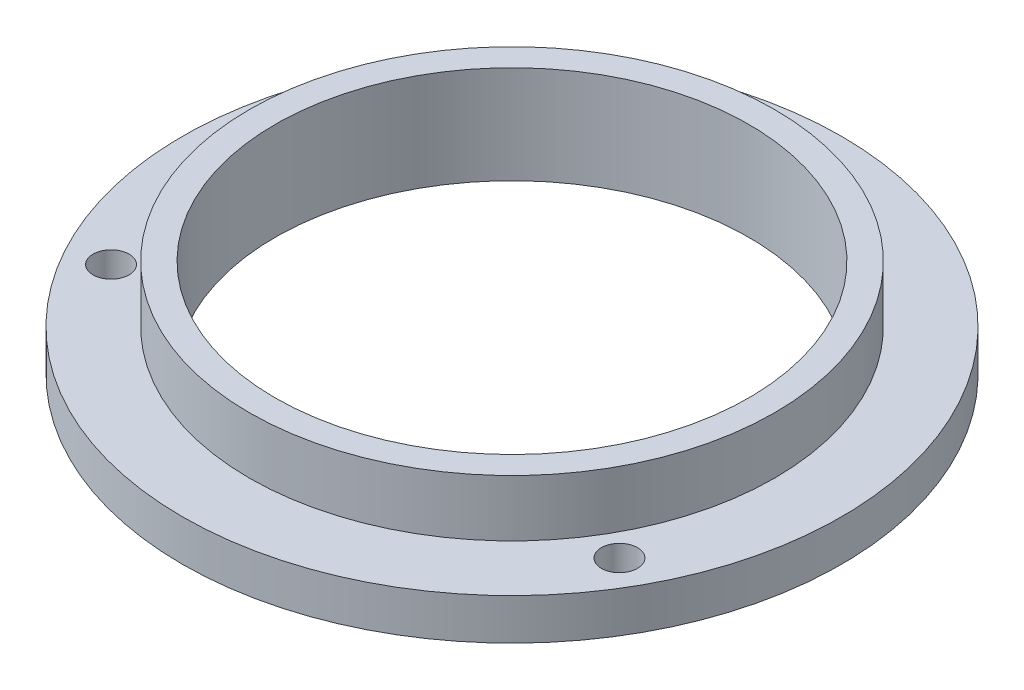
from build123d import *

# Parameters (mm, degrees)
SCHIZZO2_R               = 1.75
TAGLIO_ESTRUSIONE1_DEPTH = 46.587827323


with BuildPart() as part:
    # Schizzo1 → Rivoluzione1 (revolve)
    with BuildSketch(Plane.XY, mode=Mode.PRIVATE) as rivoluzione1_sk:
        Polygon((23, -4), (32, -4), (32, 0), (25.5, 0), (25.5, 5.5), (23, 5.5), align=None)
    revolve(rivoluzione1_sk.sketch.rotate(Axis((0, 65.172331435, 0), (0, -1, 0)), 90), axis=Axis((0, 65.172331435, 0), (0, -1, 0)))

    # Schizzo2 → Taglio-Estrusione1 (cut, through all)
    with BuildSketch(Plane(origin=(0, 0, 0), x_dir=(1, 0, 0), z_dir=(0, 1, 0))):
        with Locations(Location((0, 28.5, 0), (0, 0, 270))):
            Circle(SCHIZZO2_R)
        with Locations(Location((24.681724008, -14.25, 0), (0, 0, 270))):
            Circle(SCHIZZO2_R)
        with Locations(Location((-24.681724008, -14.25, 0), (0, 0, 270))):
            Circle(SCHIZZO2_R)
    extrude(amount=-TAGLIO_ESTRUSIONE1_DEPTH, mode=Mode.SUBTRACT)


solid = part.part
